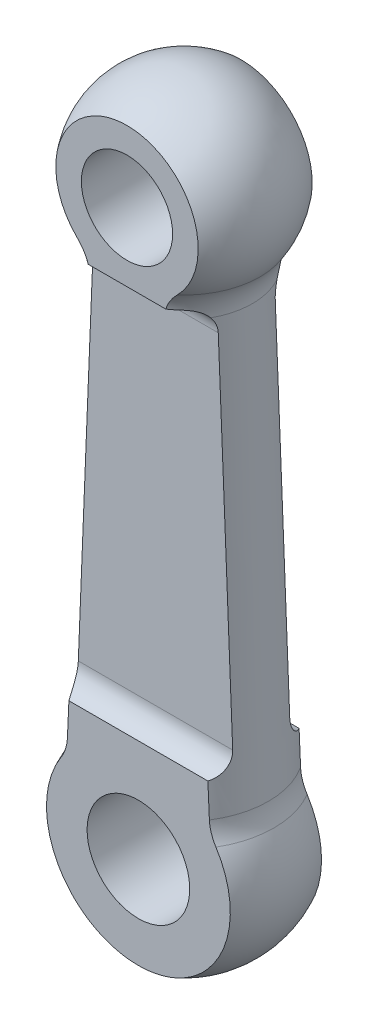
from build123d import *

# Parameters (mm, degrees)
CUT_EXTRUDE1_DEPTH      = 30.690065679
CUT_EXTRUDE1_DEPTH_BACK = 30.690065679
SKETCH2_R               = 2
SKETCH2_R_2             = 2.25
CUT_EXTRUDE2_DEPTH      = 30.6051944
CUT_EXTRUDE2_DEPTH_BACK = 30.6051944
SKETCH3_OUTSIDE_W       = 16.912
SKETCH3_OUTSIDE_H       = 42.61


with BuildPart() as part:
    # Sketch1 → Revolve1 (revolve)
    with BuildSketch(Plane.XY, mode=Mode.PRIVATE) as revolve1_sk:
        with BuildLine():
            Line((0, 29), (0, -4.5))
            ThreePointArc((0, -4.5), (3.872392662, -2.292285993), (3.945169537, 2.1646333))
            ThreePointArc((3.945169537, 2.1646333), (3.770913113, 2.59367544), (3.7, 3.051292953))
            Line((3.7, 3.051292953), (3, 21.605833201))
            ThreePointArc((3, 21.605833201), (3.073295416, 22.222791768), (3.33238548, 22.787488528))
            ThreePointArc((3.33238548, 22.787488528), (3.524914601, 26.890760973), (0, 29))
        make_face()
    revolve(revolve1_sk.sketch.rotate(Axis((0, 0, 0), (0, 1, 0)), 90), axis=Axis((0, 0, 0), (0, 1, 0)))

    # Sketch2 → Cut-Extrude1 (cut, two sides: drawn at the far end of the back side and taken through both)
    with BuildSketch(Plane.XY.offset(-CUT_EXTRUDE1_DEPTH_BACK)):
        with Locations((0, 25)):
            Circle(SKETCH2_R)
        with Locations(Location((0, 0, 0), (0, 0, 74.166628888))):
            Circle(SKETCH2_R_2)
    extrude(amount=CUT_EXTRUDE1_DEPTH + CUT_EXTRUDE1_DEPTH_BACK, mode=Mode.SUBTRACT)

    # Sketch3 outside → Cut-Extrude2 (cut, two sides: drawn at the far end of the back side and taken through both)
    with BuildSketch(Plane(origin=(0, 0, 0), x_dir=(0, 0, -1), z_dir=(1, 0, 0)).offset(-CUT_EXTRUDE2_DEPTH_BACK)):
        with Locations((0, 12.25)):
            Rectangle(SKETCH3_OUTSIDE_W, SKETCH3_OUTSIDE_H)
        with BuildLine():
            Line((-2.5, 29), (2.5, 29))
            Line((2.5, 29), (2.5, 22))
            Line((2.5, 22), (2.25, 22))
            ThreePointArc((2.25, 22), (1.542893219, 21.707106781), (1.25, 21))
            Line((1.25, 21), (1.25, 5.468245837))
            ThreePointArc((1.25, 5.468245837), (1.459430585, 4.855873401), (2, 4.5))
            Line((2, 4.5), (2, -5))
            Line((2, -5), (-2, -5))
            Line((-2, -5), (-2, 4.5))
            ThreePointArc((-2, 4.5), (-1.459430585, 4.855873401), (-1.25, 5.468245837))
            Line((-1.25, 5.468245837), (-1.25, 21))
            ThreePointArc((-1.25, 21), (-1.542893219, 21.707106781), (-2.25, 22))
            Line((-2.25, 22), (-2.5, 22))
            Line((-2.5, 22), (-2.5, 29))
        make_face(mode=Mode.SUBTRACT)
    extrude(amount=CUT_EXTRUDE2_DEPTH + CUT_EXTRUDE2_DEPTH_BACK, mode=Mode.SUBTRACT)


solid = part.part
